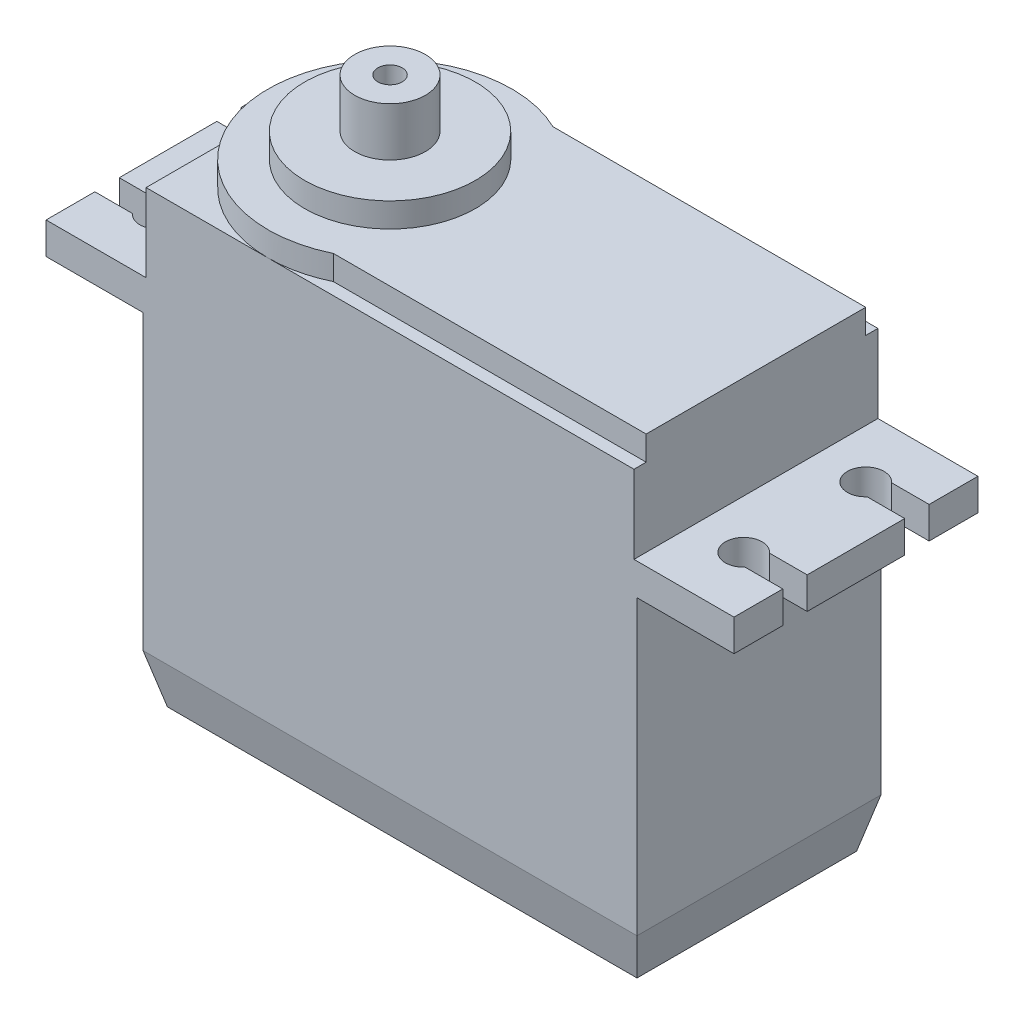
ISO-10303-21;
HEADER;
FILE_DESCRIPTION(('STEP AP214'),'2;1');
FILE_NAME('part.step','',(''),(''),'','','');
FILE_SCHEMA(('AUTOMOTIVE_DESIGN { 1 0 10303 214 1 1 1 1 }'));
ENDSEC;
DATA;
#1=APPLICATION_CONTEXT('core data for automotive mechanical design processes');
#2=APPLICATION_PROTOCOL_DEFINITION('international standard','automotive_design',2000,#1);
#3=PRODUCT_CONTEXT('',#1,'mechanical');
#4=PRODUCT('Part','Part','',(#3));
#5=PRODUCT_RELATED_PRODUCT_CATEGORY('part','',(#4));
#6=PRODUCT_DEFINITION_FORMATION('','',#4);
#7=PRODUCT_DEFINITION_CONTEXT('part definition',#1,'design');
#8=PRODUCT_DEFINITION('design','',#6,#7);
#9=PRODUCT_DEFINITION_SHAPE('','',#8);
#10=(LENGTH_UNIT() NAMED_UNIT(*) SI_UNIT(.MILLI.,.METRE.));
#11=(NAMED_UNIT(*) PLANE_ANGLE_UNIT() SI_UNIT($,.RADIAN.));
#12=(NAMED_UNIT(*) SI_UNIT($,.STERADIAN.) SOLID_ANGLE_UNIT());
#13=UNCERTAINTY_MEASURE_WITH_UNIT(LENGTH_MEASURE(1.E-05),#10,'distance_accuracy_value','');
#14=(GEOMETRIC_REPRESENTATION_CONTEXT(3) GLOBAL_UNCERTAINTY_ASSIGNED_CONTEXT((#13)) GLOBAL_UNIT_ASSIGNED_CONTEXT((#10,
#11,#12)) REPRESENTATION_CONTEXT('',''));
#15=CARTESIAN_POINT('',(0.,0.,0.));
#16=DIRECTION('',(0.,0.,1.));
#17=DIRECTION('',(1.,0.,0.));
#18=AXIS2_PLACEMENT_3D('',#15,#16,#17);
#19=CARTESIAN_POINT('',(-9.99999999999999,27.,10.));
#20=DIRECTION('',(0.,1.,0.));
#21=DIRECTION('',(0.,0.,1.));
#22=AXIS2_PLACEMENT_3D('',#19,#20,#21);
#23=PLANE('',#22);
#24=CARTESIAN_POINT('',(-9.99999999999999,27.,10.));
#25=DIRECTION('',(0.,1.,0.));
#26=DIRECTION('',(0.,0.,1.));
#27=AXIS2_PLACEMENT_3D('',#24,#25,#26);
#28=CIRCLE('',#27,7.);
#29=CARTESIAN_POINT('',(-9.99999999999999,27.,17.));
#30=VERTEX_POINT('',#29);
#31=EDGE_CURVE('E585',#30,#30,#28,.T.);
#32=ORIENTED_EDGE('',*,*,#31,.T.);
#33=EDGE_LOOP('',(#32));
#34=FACE_BOUND('',#33,.T.);
#35=CARTESIAN_POINT('',(-9.99999999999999,27.,10.));
#36=DIRECTION('',(0.,1.,0.));
#37=DIRECTION('',(0.,0.,1.));
#38=AXIS2_PLACEMENT_3D('',#35,#36,#37);
#39=CIRCLE('',#38,2.9);
#40=CARTESIAN_POINT('',(-9.99999999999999,27.,12.9));
#41=VERTEX_POINT('',#40);
#42=EDGE_CURVE('E628',#41,#41,#39,.T.);
#43=ORIENTED_EDGE('',*,*,#42,.F.);
#44=EDGE_LOOP('',(#43));
#45=FACE_BOUND('',#44,.T.);
#46=ADVANCED_FACE('F34',(#34,#45),#23,.T.);
#47=CARTESIAN_POINT('',(-9.99999999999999,25.,10.));
#48=DIRECTION('',(0.,1.,0.));
#49=DIRECTION('',(0.,0.,1.));
#50=AXIS2_PLACEMENT_3D('',#47,#48,#49);
#51=PLANE('',#50);
#52=DIRECTION('',(0.,0.,-1.));
#53=VECTOR('',#52,1.);
#54=CARTESIAN_POINT('',(20.,25.,19.));
#55=LINE('',#54,#53);
#56=CARTESIAN_POINT('',(20.,25.,19.));
#57=VERTEX_POINT('',#56);
#58=CARTESIAN_POINT('',(20.,25.,1.));
#59=VERTEX_POINT('',#58);
#60=EDGE_CURVE('E275',#57,#59,#55,.T.);
#61=ORIENTED_EDGE('',*,*,#60,.T.);
#62=DIRECTION('',(-1.,0.,0.));
#63=VECTOR('',#62,1.);
#64=CARTESIAN_POINT('',(20.,25.,1.));
#65=LINE('',#64,#63);
#66=CARTESIAN_POINT('',(-5.64110105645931,25.,1.));
#67=VERTEX_POINT('',#66);
#68=EDGE_CURVE('E264',#59,#67,#65,.T.);
#69=ORIENTED_EDGE('',*,*,#68,.T.);
#70=CARTESIAN_POINT('',(-9.99999999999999,25.,10.));
#71=DIRECTION('',(0.,1.,0.));
#72=DIRECTION('',(0.,0.,1.));
#73=AXIS2_PLACEMENT_3D('',#70,#71,#72);
#74=CIRCLE('',#73,10.);
#75=CARTESIAN_POINT('',(-5.64110105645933,25.,19.));
#76=VERTEX_POINT('',#75);
#77=EDGE_CURVE('E274',#67,#76,#74,.T.);
#78=ORIENTED_EDGE('',*,*,#77,.T.);
#79=DIRECTION('',(1.,0.,0.));
#80=VECTOR('',#79,1.);
#81=CARTESIAN_POINT('',(20.,25.,19.));
#82=LINE('',#81,#80);
#83=EDGE_CURVE('E281',#76,#57,#82,.T.);
#84=ORIENTED_EDGE('',*,*,#83,.T.);
#85=EDGE_LOOP('',(#61,#69,#78,#84));
#86=FACE_BOUND('',#85,.T.);
#87=CARTESIAN_POINT('',(-9.99999999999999,25.,10.));
#88=DIRECTION('',(0.,1.,0.));
#89=DIRECTION('',(0.,0.,1.));
#90=AXIS2_PLACEMENT_3D('',#87,#88,#89);
#91=CIRCLE('',#90,7.);
#92=CARTESIAN_POINT('',(-9.99999999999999,25.,17.));
#93=VERTEX_POINT('',#92);
#94=EDGE_CURVE('E623',#93,#93,#91,.T.);
#95=ORIENTED_EDGE('',*,*,#94,.F.);
#96=EDGE_LOOP('',(#95));
#97=FACE_BOUND('',#96,.T.);
#98=ADVANCED_FACE('F278',(#86,#97),#51,.T.);
#99=CARTESIAN_POINT('',(0.,23.,0.));
#100=DIRECTION('',(0.,1.,0.));
#101=DIRECTION('',(0.,0.,1.));
#102=AXIS2_PLACEMENT_3D('',#99,#100,#101);
#103=PLANE('',#102);
#104=DIRECTION('',(1.,0.,0.));
#105=VECTOR('',#104,1.);
#106=CARTESIAN_POINT('',(20.,23.,19.));
#107=LINE('',#106,#105);
#108=CARTESIAN_POINT('',(-5.64110105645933,23.,19.));
#109=VERTEX_POINT('',#108);
#110=CARTESIAN_POINT('',(20.,23.,19.));
#111=VERTEX_POINT('',#110);
#112=EDGE_CURVE('E285',#109,#111,#107,.T.);
#113=ORIENTED_EDGE('',*,*,#112,.F.);
#114=CARTESIAN_POINT('',(-9.99999999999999,23.,10.));
#115=DIRECTION('',(0.,1.,0.));
#116=DIRECTION('',(0.,0.,1.));
#117=AXIS2_PLACEMENT_3D('',#114,#115,#116);
#118=CIRCLE('',#117,10.);
#119=CARTESIAN_POINT('',(-9.99999999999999,23.,20.));
#120=VERTEX_POINT('',#119);
#121=EDGE_CURVE('E578',#120,#109,#118,.T.);
#122=ORIENTED_EDGE('',*,*,#121,.F.);
#123=DIRECTION('',(1.,0.,0.));
#124=VECTOR('',#123,1.);
#125=CARTESIAN_POINT('',(-20.,23.,20.));
#126=LINE('',#125,#124);
#127=CARTESIAN_POINT('',(20.,23.,20.));
#128=VERTEX_POINT('',#127);
#129=EDGE_CURVE('E462',#120,#128,#126,.T.);
#130=ORIENTED_EDGE('',*,*,#129,.T.);
#131=DIRECTION('',(0.,0.,-1.));
#132=VECTOR('',#131,1.);
#133=CARTESIAN_POINT('',(20.,23.,0.));
#134=LINE('',#133,#132);
#135=EDGE_CURVE('E473',#128,#111,#134,.T.);
#136=ORIENTED_EDGE('',*,*,#135,.T.);
#137=EDGE_LOOP('',(#113,#122,#130,#136));
#138=FACE_BOUND('',#137,.T.);
#139=ADVANCED_FACE('F576',(#138),#103,.T.);
#140=CARTESIAN_POINT('',(-20.,23.,10.));
#141=VERTEX_POINT('',#140);
#142=EDGE_CURVE('E573',#141,#120,#118,.T.);
#143=ORIENTED_EDGE('',*,*,#142,.F.);
#144=DIRECTION('',(0.,0.,1.));
#145=VECTOR('',#144,1.);
#146=CARTESIAN_POINT('',(-20.,23.,0.));
#147=LINE('',#146,#145);
#148=CARTESIAN_POINT('',(-20.,23.,20.));
#149=VERTEX_POINT('',#148);
#150=EDGE_CURVE('E458',#141,#149,#147,.T.);
#151=ORIENTED_EDGE('',*,*,#150,.T.);
#152=EDGE_CURVE('E463',#149,#120,#126,.T.);
#153=ORIENTED_EDGE('',*,*,#152,.T.);
#154=EDGE_LOOP('',(#143,#151,#153));
#155=FACE_BOUND('',#154,.T.);
#156=ADVANCED_FACE('F571',(#155),#103,.T.);
#157=CARTESIAN_POINT('',(-9.99999999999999,23.,0.));
#158=VERTEX_POINT('',#157);
#159=EDGE_CURVE('E478',#158,#141,#118,.T.);
#160=ORIENTED_EDGE('',*,*,#159,.F.);
#161=DIRECTION('',(-1.,0.,0.));
#162=VECTOR('',#161,1.);
#163=CARTESIAN_POINT('',(-20.,23.,0.));
#164=LINE('',#163,#162);
#165=CARTESIAN_POINT('',(-20.,23.,0.));
#166=VERTEX_POINT('',#165);
#167=EDGE_CURVE('E475',#158,#166,#164,.T.);
#168=ORIENTED_EDGE('',*,*,#167,.T.);
#169=EDGE_CURVE('E459',#166,#141,#147,.T.);
#170=ORIENTED_EDGE('',*,*,#169,.T.);
#171=EDGE_LOOP('',(#160,#168,#170));
#172=FACE_BOUND('',#171,.T.);
#173=ADVANCED_FACE('F561',(#172),#103,.T.);
#174=CARTESIAN_POINT('',(-28.2,14.,20.));
#175=DIRECTION('',(0.,-1.,0.));
#176=DIRECTION('',(0.,0.,-1.));
#177=AXIS2_PLACEMENT_3D('',#174,#175,#176);
#178=PLANE('',#177);
#179=CARTESIAN_POINT('',(-24.,14.,5.));
#180=DIRECTION('',(0.,-1.,0.));
#181=DIRECTION('',(0.,0.,-1.));
#182=AXIS2_PLACEMENT_3D('',#179,#180,#181);
#183=CIRCLE('',#182,1.5);
#184=CARTESIAN_POINT('',(-25.1180339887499,14.,6.));
#185=VERTEX_POINT('',#184);
#186=CARTESIAN_POINT('',(-25.1180339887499,14.,4.));
#187=VERTEX_POINT('',#186);
#188=EDGE_CURVE('E331',#185,#187,#183,.F.);
#189=ORIENTED_EDGE('',*,*,#188,.T.);
#190=DIRECTION('',(-1.,0.,0.));
#191=VECTOR('',#190,1.);
#192=CARTESIAN_POINT('',(-28.2,14.,4.));
#193=LINE('',#192,#191);
#194=CARTESIAN_POINT('',(-28.2,14.,4.));
#195=VERTEX_POINT('',#194);
#196=EDGE_CURVE('E328',#187,#195,#193,.T.);
#197=ORIENTED_EDGE('',*,*,#196,.T.);
#198=DIRECTION('',(0.,0.,-1.));
#199=VECTOR('',#198,1.);
#200=CARTESIAN_POINT('',(-28.2,14.,20.));
#201=LINE('',#200,#199);
#202=CARTESIAN_POINT('',(-28.2,14.,0.));
#203=VERTEX_POINT('',#202);
#204=EDGE_CURVE('E368',#195,#203,#201,.T.);
#205=ORIENTED_EDGE('',*,*,#204,.T.);
#206=DIRECTION('',(1.,0.,0.));
#207=VECTOR('',#206,1.);
#208=CARTESIAN_POINT('',(-28.2,14.,0.));
#209=LINE('',#208,#207);
#210=CARTESIAN_POINT('',(-20.25,14.,0.));
#211=VERTEX_POINT('',#210);
#212=EDGE_CURVE('E377',#203,#211,#209,.T.);
#213=ORIENTED_EDGE('',*,*,#212,.T.);
#214=DIRECTION('',(0.,0.,-1.));
#215=VECTOR('',#214,1.);
#216=CARTESIAN_POINT('',(-20.25,14.,20.));
#217=LINE('',#216,#215);
#218=CARTESIAN_POINT('',(-20.25,14.,20.));
#219=VERTEX_POINT('',#218);
#220=EDGE_CURVE('E519',#219,#211,#217,.T.);
#221=ORIENTED_EDGE('',*,*,#220,.F.);
#222=DIRECTION('',(1.,0.,0.));
#223=VECTOR('',#222,1.);
#224=CARTESIAN_POINT('',(-28.2,14.,20.));
#225=LINE('',#224,#223);
#226=CARTESIAN_POINT('',(-28.2,14.,20.));
#227=VERTEX_POINT('',#226);
#228=EDGE_CURVE('E372',#227,#219,#225,.T.);
#229=ORIENTED_EDGE('',*,*,#228,.F.);
#230=CARTESIAN_POINT('',(-28.2,14.,16.));
#231=VERTEX_POINT('',#230);
#232=EDGE_CURVE('E369',#227,#231,#201,.T.);
#233=ORIENTED_EDGE('',*,*,#232,.T.);
#234=DIRECTION('',(1.,0.,0.));
#235=VECTOR('',#234,1.);
#236=CARTESIAN_POINT('',(-28.2,14.,16.));
#237=LINE('',#236,#235);
#238=CARTESIAN_POINT('',(-25.1180339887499,14.,16.));
#239=VERTEX_POINT('',#238);
#240=EDGE_CURVE('E346',#231,#239,#237,.T.);
#241=ORIENTED_EDGE('',*,*,#240,.T.);
#242=CARTESIAN_POINT('',(-24.,14.,15.));
#243=DIRECTION('',(0.,-1.,0.));
#244=DIRECTION('',(0.,0.,-1.));
#245=AXIS2_PLACEMENT_3D('',#242,#243,#244);
#246=CIRCLE('',#245,1.5);
#247=CARTESIAN_POINT('',(-25.1180339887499,14.,14.));
#248=VERTEX_POINT('',#247);
#249=EDGE_CURVE('E353',#239,#248,#246,.F.);
#250=ORIENTED_EDGE('',*,*,#249,.T.);
#251=DIRECTION('',(-1.,0.,0.));
#252=VECTOR('',#251,1.);
#253=CARTESIAN_POINT('',(-28.2,14.,14.));
#254=LINE('',#253,#252);
#255=CARTESIAN_POINT('',(-28.2,14.,14.));
#256=VERTEX_POINT('',#255);
#257=EDGE_CURVE('E350',#248,#256,#254,.T.);
#258=ORIENTED_EDGE('',*,*,#257,.T.);
#259=CARTESIAN_POINT('',(-28.2,14.,6.));
#260=VERTEX_POINT('',#259);
#261=EDGE_CURVE('E373',#256,#260,#201,.T.);
#262=ORIENTED_EDGE('',*,*,#261,.T.);
#263=DIRECTION('',(1.,0.,0.));
#264=VECTOR('',#263,1.);
#265=CARTESIAN_POINT('',(-28.2,14.,6.));
#266=LINE('',#265,#264);
#267=EDGE_CURVE('E324',#260,#185,#266,.T.);
#268=ORIENTED_EDGE('',*,*,#267,.T.);
#269=EDGE_LOOP('',(#189,#197,#205,#213,#221,#229,#233,#241,#250,#258,#262,#268));
#270=FACE_BOUND('',#269,.T.);
#271=ADVANCED_FACE('F701',(#270),#178,.T.);
#272=CARTESIAN_POINT('',(-28.2,16.6,20.));
#273=DIRECTION('',(0.,1.,0.));
#274=DIRECTION('',(0.,0.,1.));
#275=AXIS2_PLACEMENT_3D('',#272,#273,#274);
#276=PLANE('',#275);
#277=DIRECTION('',(0.,0.,1.));
#278=VECTOR('',#277,1.);
#279=CARTESIAN_POINT('',(-28.2,16.6,20.));
#280=LINE('',#279,#278);
#281=CARTESIAN_POINT('',(-28.2,16.6,0.));
#282=VERTEX_POINT('',#281);
#283=CARTESIAN_POINT('',(-28.2,16.6,4.));
#284=VERTEX_POINT('',#283);
#285=EDGE_CURVE('E361',#282,#284,#280,.T.);
#286=ORIENTED_EDGE('',*,*,#285,.T.);
#287=DIRECTION('',(1.,0.,0.));
#288=VECTOR('',#287,1.);
#289=CARTESIAN_POINT('',(-28.2,16.6,4.));
#290=LINE('',#289,#288);
#291=CARTESIAN_POINT('',(-25.1180339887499,16.6,4.));
#292=VERTEX_POINT('',#291);
#293=EDGE_CURVE('E291',#284,#292,#290,.T.);
#294=ORIENTED_EDGE('',*,*,#293,.T.);
#295=CARTESIAN_POINT('',(-24.,16.6,5.));
#296=DIRECTION('',(0.,-1.,0.));
#297=DIRECTION('',(0.,0.,1.));
#298=AXIS2_PLACEMENT_3D('',#295,#296,#297);
#299=CIRCLE('',#298,1.5);
#300=CARTESIAN_POINT('',(-25.1180339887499,16.6,6.));
#301=VERTEX_POINT('',#300);
#302=EDGE_CURVE('E318',#292,#301,#299,.T.);
#303=ORIENTED_EDGE('',*,*,#302,.T.);
#304=DIRECTION('',(-1.,0.,0.));
#305=VECTOR('',#304,1.);
#306=CARTESIAN_POINT('',(-28.2,16.6,6.));
#307=LINE('',#306,#305);
#308=CARTESIAN_POINT('',(-28.2,16.6,6.));
#309=VERTEX_POINT('',#308);
#310=EDGE_CURVE('E294',#301,#309,#307,.T.);
#311=ORIENTED_EDGE('',*,*,#310,.T.);
#312=CARTESIAN_POINT('',(-28.2,16.6,14.));
#313=VERTEX_POINT('',#312);
#314=EDGE_CURVE('E365',#309,#313,#280,.T.);
#315=ORIENTED_EDGE('',*,*,#314,.T.);
#316=DIRECTION('',(1.,0.,0.));
#317=VECTOR('',#316,1.);
#318=CARTESIAN_POINT('',(-28.2,16.6,14.));
#319=LINE('',#318,#317);
#320=CARTESIAN_POINT('',(-25.1180339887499,16.6,14.));
#321=VERTEX_POINT('',#320);
#322=EDGE_CURVE('E340',#313,#321,#319,.T.);
#323=ORIENTED_EDGE('',*,*,#322,.T.);
#324=CARTESIAN_POINT('',(-24.,16.6,15.));
#325=DIRECTION('',(0.,-1.,0.));
#326=DIRECTION('',(0.,0.,1.));
#327=AXIS2_PLACEMENT_3D('',#324,#325,#326);
#328=CIRCLE('',#327,1.5);
#329=CARTESIAN_POINT('',(-25.1180339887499,16.6,16.));
#330=VERTEX_POINT('',#329);
#331=EDGE_CURVE('E337',#321,#330,#328,.T.);
#332=ORIENTED_EDGE('',*,*,#331,.T.);
#333=DIRECTION('',(-1.,0.,0.));
#334=VECTOR('',#333,1.);
#335=CARTESIAN_POINT('',(-28.2,16.6,16.));
#336=LINE('',#335,#334);
#337=CARTESIAN_POINT('',(-28.2,16.6,16.));
#338=VERTEX_POINT('',#337);
#339=EDGE_CURVE('E334',#330,#338,#336,.T.);
#340=ORIENTED_EDGE('',*,*,#339,.T.);
#341=CARTESIAN_POINT('',(-28.2,16.6,20.));
#342=VERTEX_POINT('',#341);
#343=EDGE_CURVE('E360',#338,#342,#280,.T.);
#344=ORIENTED_EDGE('',*,*,#343,.T.);
#345=DIRECTION('',(1.,0.,0.));
#346=VECTOR('',#345,1.);
#347=CARTESIAN_POINT('',(-28.2,16.6,20.));
#348=LINE('',#347,#346);
#349=CARTESIAN_POINT('',(-20.,16.6,20.));
#350=VERTEX_POINT('',#349);
#351=EDGE_CURVE('E383',#342,#350,#348,.T.);
#352=ORIENTED_EDGE('',*,*,#351,.T.);
#353=DIRECTION('',(0.,0.,1.));
#354=VECTOR('',#353,1.);
#355=CARTESIAN_POINT('',(-20.,16.6,20.));
#356=LINE('',#355,#354);
#357=CARTESIAN_POINT('',(-20.,16.6,0.));
#358=VERTEX_POINT('',#357);
#359=EDGE_CURVE('E356',#358,#350,#356,.T.);
#360=ORIENTED_EDGE('',*,*,#359,.F.);
#361=DIRECTION('',(1.,0.,0.));
#362=VECTOR('',#361,1.);
#363=CARTESIAN_POINT('',(-28.2,16.6,0.));
#364=LINE('',#363,#362);
#365=EDGE_CURVE('E380',#282,#358,#364,.T.);
#366=ORIENTED_EDGE('',*,*,#365,.F.);
#367=EDGE_LOOP('',(#286,#294,#303,#311,#315,#323,#332,#340,#344,#352,#360,#366));
#368=FACE_BOUND('',#367,.T.);
#369=ADVANCED_FACE('F733',(#368),#276,.T.);
#370=CARTESIAN_POINT('',(-28.2,0.,0.));
#371=DIRECTION('',(1.,0.,0.));
#372=DIRECTION('',(0.,0.,1.));
#373=AXIS2_PLACEMENT_3D('',#370,#371,#372);
#374=PLANE('',#373);
#375=DIRECTION('',(0.,-1.,0.));
#376=VECTOR('',#375,1.);
#377=CARTESIAN_POINT('',(-28.2,0.,4.));
#378=LINE('',#377,#376);
#379=EDGE_CURVE('E476',#284,#195,#378,.T.);
#380=ORIENTED_EDGE('',*,*,#379,.F.);
#381=ORIENTED_EDGE('',*,*,#285,.F.);
#382=DIRECTION('',(0.,1.,0.));
#383=VECTOR('',#382,1.);
#384=CARTESIAN_POINT('',(-28.2,14.,0.));
#385=LINE('',#384,#383);
#386=EDGE_CURVE('E364',#203,#282,#385,.T.);
#387=ORIENTED_EDGE('',*,*,#386,.F.);
#388=ORIENTED_EDGE('',*,*,#204,.F.);
#389=EDGE_LOOP('',(#380,#381,#387,#388));
#390=FACE_BOUND('',#389,.T.);
#391=ADVANCED_FACE('F731',(#390),#374,.F.);
#392=DIRECTION('',(0.,1.,0.));
#393=VECTOR('',#392,1.);
#394=CARTESIAN_POINT('',(-28.2,0.,6.));
#395=LINE('',#394,#393);
#396=EDGE_CURVE('E479',#260,#309,#395,.T.);
#397=ORIENTED_EDGE('',*,*,#396,.F.);
#398=ORIENTED_EDGE('',*,*,#261,.F.);
#399=DIRECTION('',(0.,-1.,0.));
#400=VECTOR('',#399,1.);
#401=CARTESIAN_POINT('',(-28.2,0.,14.));
#402=LINE('',#401,#400);
#403=EDGE_CURVE('E481',#313,#256,#402,.T.);
#404=ORIENTED_EDGE('',*,*,#403,.F.);
#405=ORIENTED_EDGE('',*,*,#314,.F.);
#406=EDGE_LOOP('',(#397,#398,#404,#405));
#407=FACE_BOUND('',#406,.T.);
#408=ADVANCED_FACE('F724',(#407),#374,.F.);
#409=DIRECTION('',(0.,1.,0.));
#410=VECTOR('',#409,1.);
#411=CARTESIAN_POINT('',(-28.2,0.,16.));
#412=LINE('',#411,#410);
#413=EDGE_CURVE('E483',#231,#338,#412,.T.);
#414=ORIENTED_EDGE('',*,*,#413,.F.);
#415=ORIENTED_EDGE('',*,*,#232,.F.);
#416=DIRECTION('',(0.,-1.,0.));
#417=VECTOR('',#416,1.);
#418=CARTESIAN_POINT('',(-28.2,14.,20.));
#419=LINE('',#418,#417);
#420=EDGE_CURVE('E357',#342,#227,#419,.T.);
#421=ORIENTED_EDGE('',*,*,#420,.F.);
#422=ORIENTED_EDGE('',*,*,#343,.F.);
#423=EDGE_LOOP('',(#414,#415,#421,#422));
#424=FACE_BOUND('',#423,.T.);
#425=ADVANCED_FACE('F707',(#424),#374,.F.);
#426=CARTESIAN_POINT('',(28.2,0.,0.));
#427=DIRECTION('',(-1.,0.,0.));
#428=DIRECTION('',(0.,0.,1.));
#429=AXIS2_PLACEMENT_3D('',#426,#427,#428);
#430=PLANE('',#429);
#431=DIRECTION('',(0.,0.,1.));
#432=VECTOR('',#431,1.);
#433=CARTESIAN_POINT('',(28.2,16.6,20.));
#434=LINE('',#433,#432);
#435=CARTESIAN_POINT('',(28.2,16.6,0.));
#436=VERTEX_POINT('',#435);
#437=CARTESIAN_POINT('',(28.2,16.6,4.));
#438=VERTEX_POINT('',#437);
#439=EDGE_CURVE('E440',#436,#438,#434,.T.);
#440=ORIENTED_EDGE('',*,*,#439,.T.);
#441=DIRECTION('',(0.,-1.,0.));
#442=VECTOR('',#441,1.);
#443=CARTESIAN_POINT('',(28.2,0.,4.));
#444=LINE('',#443,#442);
#445=CARTESIAN_POINT('',(28.2,14.,4.));
#446=VERTEX_POINT('',#445);
#447=EDGE_CURVE('E485',#438,#446,#444,.T.);
#448=ORIENTED_EDGE('',*,*,#447,.T.);
#449=DIRECTION('',(0.,0.,-1.));
#450=VECTOR('',#449,1.);
#451=CARTESIAN_POINT('',(28.2,14.,20.));
#452=LINE('',#451,#450);
#453=CARTESIAN_POINT('',(28.2,14.,0.));
#454=VERTEX_POINT('',#453);
#455=EDGE_CURVE('E432',#446,#454,#452,.T.);
#456=ORIENTED_EDGE('',*,*,#455,.T.);
#457=DIRECTION('',(0.,1.,0.));
#458=VECTOR('',#457,1.);
#459=CARTESIAN_POINT('',(28.2,14.,0.));
#460=LINE('',#459,#458);
#461=EDGE_CURVE('E436',#454,#436,#460,.T.);
#462=ORIENTED_EDGE('',*,*,#461,.T.);
#463=EDGE_LOOP('',(#440,#448,#456,#462));
#464=FACE_BOUND('',#463,.T.);
#465=ADVANCED_FACE('F791',(#464),#430,.F.);
#466=CARTESIAN_POINT('',(28.2,14.,20.));
#467=VERTEX_POINT('',#466);
#468=CARTESIAN_POINT('',(28.2,14.,16.));
#469=VERTEX_POINT('',#468);
#470=EDGE_CURVE('E433',#467,#469,#452,.T.);
#471=ORIENTED_EDGE('',*,*,#470,.T.);
#472=DIRECTION('',(0.,1.,0.));
#473=VECTOR('',#472,1.);
#474=CARTESIAN_POINT('',(28.2,0.,16.));
#475=LINE('',#474,#473);
#476=CARTESIAN_POINT('',(28.2,16.6,16.));
#477=VERTEX_POINT('',#476);
#478=EDGE_CURVE('E491',#469,#477,#475,.T.);
#479=ORIENTED_EDGE('',*,*,#478,.T.);
#480=CARTESIAN_POINT('',(28.2,16.6,20.));
#481=VERTEX_POINT('',#480);
#482=EDGE_CURVE('E439',#477,#481,#434,.T.);
#483=ORIENTED_EDGE('',*,*,#482,.T.);
#484=DIRECTION('',(0.,-1.,0.));
#485=VECTOR('',#484,1.);
#486=CARTESIAN_POINT('',(28.2,14.,20.));
#487=LINE('',#486,#485);
#488=EDGE_CURVE('E429',#481,#467,#487,.T.);
#489=ORIENTED_EDGE('',*,*,#488,.T.);
#490=EDGE_LOOP('',(#471,#479,#483,#489));
#491=FACE_BOUND('',#490,.T.);
#492=ADVANCED_FACE('F539',(#491),#430,.F.);
#493=CARTESIAN_POINT('',(20.,23.,0.));
#494=DIRECTION('',(-1.,0.,0.));
#495=DIRECTION('',(0.,0.,1.));
#496=AXIS2_PLACEMENT_3D('',#493,#494,#495);
#497=PLANE('',#496);
#498=DIRECTION('',(0.,0.,1.));
#499=VECTOR('',#498,1.);
#500=CARTESIAN_POINT('',(20.,16.6,20.));
#501=LINE('',#500,#499);
#502=CARTESIAN_POINT('',(20.,16.6,0.));
#503=VERTEX_POINT('',#502);
#504=CARTESIAN_POINT('',(20.,16.6,20.));
#505=VERTEX_POINT('',#504);
#506=EDGE_CURVE('E428',#503,#505,#501,.T.);
#507=ORIENTED_EDGE('',*,*,#506,.F.);
#508=DIRECTION('',(0.,-1.,0.));
#509=VECTOR('',#508,1.);
#510=CARTESIAN_POINT('',(20.,23.,0.));
#511=LINE('',#510,#509);
#512=CARTESIAN_POINT('',(20.,23.,0.));
#513=VERTEX_POINT('',#512);
#514=EDGE_CURVE('E502',#513,#503,#511,.T.);
#515=ORIENTED_EDGE('',*,*,#514,.F.);
#516=CARTESIAN_POINT('',(20.,23.,1.));
#517=VERTEX_POINT('',#516);
#518=EDGE_CURVE('E290',#517,#513,#134,.T.);
#519=ORIENTED_EDGE('',*,*,#518,.F.);
#520=DIRECTION('',(0.,-1.,0.));
#521=VECTOR('',#520,1.);
#522=CARTESIAN_POINT('',(20.,25.,1.));
#523=LINE('',#522,#521);
#524=EDGE_CURVE('E269',#59,#517,#523,.T.);
#525=ORIENTED_EDGE('',*,*,#524,.F.);
#526=ORIENTED_EDGE('',*,*,#60,.F.);
#527=DIRECTION('',(0.,-1.,0.));
#528=VECTOR('',#527,1.);
#529=CARTESIAN_POINT('',(20.,25.,19.));
#530=LINE('',#529,#528);
#531=EDGE_CURVE('E308',#57,#111,#530,.T.);
#532=ORIENTED_EDGE('',*,*,#531,.T.);
#533=ORIENTED_EDGE('',*,*,#135,.F.);
#534=DIRECTION('',(0.,-1.,0.));
#535=VECTOR('',#534,1.);
#536=CARTESIAN_POINT('',(20.,23.,20.));
#537=LINE('',#536,#535);
#538=EDGE_CURVE('E509',#128,#505,#537,.T.);
#539=ORIENTED_EDGE('',*,*,#538,.T.);
#540=EDGE_LOOP('',(#507,#515,#519,#525,#526,#532,#533,#539));
#541=FACE_BOUND('',#540,.T.);
#542=ADVANCED_FACE('F288',(#541),#497,.F.);
#543=CARTESIAN_POINT('',(20.25,14.,20.));
#544=DIRECTION('',(-1.,0.,0.));
#545=DIRECTION('',(0.,-1.,0.));
#546=AXIS2_PLACEMENT_3D('',#543,#544,#545);
#547=PLANE('',#546);
#548=DIRECTION('',(0.,1.,0.));
#549=VECTOR('',#548,1.);
#550=CARTESIAN_POINT('',(20.25,14.,20.));
#551=LINE('',#550,#549);
#552=CARTESIAN_POINT('',(20.25,-9.99999999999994,20.));
#553=VERTEX_POINT('',#552);
#554=CARTESIAN_POINT('',(20.25,14.,20.));
#555=VERTEX_POINT('',#554);
#556=EDGE_CURVE('E524',#553,#555,#551,.T.);
#557=ORIENTED_EDGE('',*,*,#556,.F.);
#558=DIRECTION('',(0.,0.,-1.));
#559=VECTOR('',#558,1.);
#560=CARTESIAN_POINT('',(20.25,-9.99999999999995,20.));
#561=LINE('',#560,#559);
#562=CARTESIAN_POINT('',(20.25,-9.99999999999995,0.));
#563=VERTEX_POINT('',#562);
#564=EDGE_CURVE('E678',#553,#563,#561,.T.);
#565=ORIENTED_EDGE('',*,*,#564,.T.);
#566=DIRECTION('',(0.,1.,0.));
#567=VECTOR('',#566,1.);
#568=CARTESIAN_POINT('',(20.25,14.,0.));
#569=LINE('',#568,#567);
#570=CARTESIAN_POINT('',(20.25,14.,0.));
#571=VERTEX_POINT('',#570);
#572=EDGE_CURVE('E508',#563,#571,#569,.T.);
#573=ORIENTED_EDGE('',*,*,#572,.T.);
#574=DIRECTION('',(0.,0.,-1.));
#575=VECTOR('',#574,1.);
#576=CARTESIAN_POINT('',(20.25,14.,20.));
#577=LINE('',#576,#575);
#578=EDGE_CURVE('E497',#555,#571,#577,.T.);
#579=ORIENTED_EDGE('',*,*,#578,.F.);
#580=EDGE_LOOP('',(#557,#565,#573,#579));
#581=FACE_BOUND('',#580,.T.);
#582=ADVANCED_FACE('F532',(#581),#547,.F.);
#583=CARTESIAN_POINT('',(-20.25,14.,20.));
#584=DIRECTION('',(1.,0.,0.));
#585=DIRECTION('',(0.,1.,0.));
#586=AXIS2_PLACEMENT_3D('',#583,#584,#585);
#587=PLANE('',#586);
#588=DIRECTION('',(0.,-1.,0.));
#589=VECTOR('',#588,1.);
#590=CARTESIAN_POINT('',(-20.25,14.,0.));
#591=LINE('',#590,#589);
#592=CARTESIAN_POINT('',(-20.25,-9.99999999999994,0.));
#593=VERTEX_POINT('',#592);
#594=EDGE_CURVE('E522',#211,#593,#591,.T.);
#595=ORIENTED_EDGE('',*,*,#594,.T.);
#596=DIRECTION('',(0.,0.,1.));
#597=VECTOR('',#596,1.);
#598=CARTESIAN_POINT('',(-20.25,-9.99999999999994,20.));
#599=LINE('',#598,#597);
#600=CARTESIAN_POINT('',(-20.25,-9.99999999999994,20.));
#601=VERTEX_POINT('',#600);
#602=EDGE_CURVE('E43',#593,#601,#599,.T.);
#603=ORIENTED_EDGE('',*,*,#602,.T.);
#604=DIRECTION('',(0.,-1.,0.));
#605=VECTOR('',#604,1.);
#606=CARTESIAN_POINT('',(-20.25,14.,20.));
#607=LINE('',#606,#605);
#608=EDGE_CURVE('E521',#219,#601,#607,.T.);
#609=ORIENTED_EDGE('',*,*,#608,.F.);
#610=ORIENTED_EDGE('',*,*,#220,.T.);
#611=EDGE_LOOP('',(#595,#603,#609,#610));
#612=FACE_BOUND('',#611,.T.);
#613=ADVANCED_FACE('F698',(#612),#587,.F.);
#614=CARTESIAN_POINT('',(-20.25,-14.,20.));
#615=DIRECTION('',(0.,1.,0.));
#616=DIRECTION('',(0.,0.,1.));
#617=AXIS2_PLACEMENT_3D('',#614,#615,#616);
#618=PLANE('',#617);
#619=DIRECTION('',(0.,0.,-1.));
#620=VECTOR('',#619,1.);
#621=CARTESIAN_POINT('',(-19.25,-14.,20.));
#622=LINE('',#621,#620);
#623=CARTESIAN_POINT('',(-19.25,-14.,19.));
#624=VERTEX_POINT('',#623);
#625=CARTESIAN_POINT('',(-19.25,-14.,1.));
#626=VERTEX_POINT('',#625);
#627=EDGE_CURVE('E582',#624,#626,#622,.T.);
#628=ORIENTED_EDGE('',*,*,#627,.T.);
#629=DIRECTION('',(1.,0.,0.));
#630=VECTOR('',#629,1.);
#631=CARTESIAN_POINT('',(-20.25,-14.,1.));
#632=LINE('',#631,#630);
#633=CARTESIAN_POINT('',(19.25,-14.,1.));
#634=VERTEX_POINT('',#633);
#635=EDGE_CURVE('E684',#626,#634,#632,.T.);
#636=ORIENTED_EDGE('',*,*,#635,.T.);
#637=DIRECTION('',(0.,0.,1.));
#638=VECTOR('',#637,1.);
#639=CARTESIAN_POINT('',(19.25,-14.,20.));
#640=LINE('',#639,#638);
#641=CARTESIAN_POINT('',(19.25,-14.,19.));
#642=VERTEX_POINT('',#641);
#643=EDGE_CURVE('E1128',#634,#642,#640,.T.);
#644=ORIENTED_EDGE('',*,*,#643,.T.);
#645=DIRECTION('',(-1.,0.,0.));
#646=VECTOR('',#645,1.);
#647=CARTESIAN_POINT('',(-20.25,-14.,19.));
#648=LINE('',#647,#646);
#649=EDGE_CURVE('E581',#642,#624,#648,.T.);
#650=ORIENTED_EDGE('',*,*,#649,.T.);
#651=EDGE_LOOP('',(#628,#636,#644,#650));
#652=FACE_BOUND('',#651,.T.);
#653=ADVANCED_FACE('F805',(#652),#618,.F.);
#654=CARTESIAN_POINT('',(0.,0.,20.));
#655=DIRECTION('',(0.,0.,1.));
#656=DIRECTION('',(1.,0.,0.));
#657=AXIS2_PLACEMENT_3D('',#654,#655,#656);
#658=PLANE('',#657);
#659=ORIENTED_EDGE('',*,*,#608,.T.);
#660=DIRECTION('',(1.,0.,0.));
#661=VECTOR('',#660,1.);
#662=CARTESIAN_POINT('',(20.25,-9.99999999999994,20.));
#663=LINE('',#662,#661);
#664=EDGE_CURVE('E11',#601,#553,#663,.T.);
#665=ORIENTED_EDGE('',*,*,#664,.T.);
#666=ORIENTED_EDGE('',*,*,#556,.T.);
#667=DIRECTION('',(-1.,0.,0.));
#668=VECTOR('',#667,1.);
#669=CARTESIAN_POINT('',(28.2,14.,20.));
#670=LINE('',#669,#668);
#671=EDGE_CURVE('E455',#467,#555,#670,.T.);
#672=ORIENTED_EDGE('',*,*,#671,.F.);
#673=ORIENTED_EDGE('',*,*,#488,.F.);
#674=DIRECTION('',(-1.,0.,0.));
#675=VECTOR('',#674,1.);
#676=CARTESIAN_POINT('',(28.2,16.6,20.));
#677=LINE('',#676,#675);
#678=EDGE_CURVE('E443',#481,#505,#677,.T.);
#679=ORIENTED_EDGE('',*,*,#678,.T.);
#680=ORIENTED_EDGE('',*,*,#538,.F.);
#681=ORIENTED_EDGE('',*,*,#129,.F.);
#682=ORIENTED_EDGE('',*,*,#152,.F.);
#683=DIRECTION('',(0.,-1.,0.));
#684=VECTOR('',#683,1.);
#685=CARTESIAN_POINT('',(-20.,23.,20.));
#686=LINE('',#685,#684);
#687=EDGE_CURVE('E505',#149,#350,#686,.T.);
#688=ORIENTED_EDGE('',*,*,#687,.T.);
#689=ORIENTED_EDGE('',*,*,#351,.F.);
#690=ORIENTED_EDGE('',*,*,#420,.T.);
#691=ORIENTED_EDGE('',*,*,#228,.T.);
#692=EDGE_LOOP('',(#659,#665,#666,#672,#673,#679,#680,#681,#682,#688,#689,#690,#691));
#693=FACE_BOUND('',#692,.T.);
#694=ADVANCED_FACE('F528',(#693),#658,.T.);
#695=CARTESIAN_POINT('',(0.,0.,0.));
#696=DIRECTION('',(0.,0.,1.));
#697=DIRECTION('',(1.,0.,0.));
#698=AXIS2_PLACEMENT_3D('',#695,#696,#697);
#699=PLANE('',#698);
#700=ORIENTED_EDGE('',*,*,#572,.F.);
#701=DIRECTION('',(-1.,0.,0.));
#702=VECTOR('',#701,1.);
#703=CARTESIAN_POINT('',(0.,-9.99999999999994,0.));
#704=LINE('',#703,#702);
#705=EDGE_CURVE('E680',#563,#593,#704,.T.);
#706=ORIENTED_EDGE('',*,*,#705,.T.);
#707=ORIENTED_EDGE('',*,*,#594,.F.);
#708=ORIENTED_EDGE('',*,*,#212,.F.);
#709=ORIENTED_EDGE('',*,*,#386,.T.);
#710=ORIENTED_EDGE('',*,*,#365,.T.);
#711=DIRECTION('',(0.,-1.,0.));
#712=VECTOR('',#711,1.);
#713=CARTESIAN_POINT('',(-20.,23.,0.));
#714=LINE('',#713,#712);
#715=EDGE_CURVE('E500',#166,#358,#714,.T.);
#716=ORIENTED_EDGE('',*,*,#715,.F.);
#717=ORIENTED_EDGE('',*,*,#167,.F.);
#718=EDGE_CURVE('E468',#513,#158,#164,.T.);
#719=ORIENTED_EDGE('',*,*,#718,.F.);
#720=ORIENTED_EDGE('',*,*,#514,.T.);
#721=DIRECTION('',(-1.,0.,0.));
#722=VECTOR('',#721,1.);
#723=CARTESIAN_POINT('',(28.2,16.6,0.));
#724=LINE('',#723,#722);
#725=EDGE_CURVE('E449',#436,#503,#724,.T.);
#726=ORIENTED_EDGE('',*,*,#725,.F.);
#727=ORIENTED_EDGE('',*,*,#461,.F.);
#728=DIRECTION('',(-1.,0.,0.));
#729=VECTOR('',#728,1.);
#730=CARTESIAN_POINT('',(28.2,14.,0.));
#731=LINE('',#730,#729);
#732=EDGE_CURVE('E452',#454,#571,#731,.T.);
#733=ORIENTED_EDGE('',*,*,#732,.T.);
#734=EDGE_LOOP('',(#700,#706,#707,#708,#709,#710,#716,#717,#719,#720,#726,#727,#733));
#735=FACE_BOUND('',#734,.T.);
#736=ADVANCED_FACE('F553',(#735),#699,.F.);
#737=CARTESIAN_POINT('',(-20.,23.,0.));
#738=DIRECTION('',(1.,0.,0.));
#739=DIRECTION('',(0.,0.,-1.));
#740=AXIS2_PLACEMENT_3D('',#737,#738,#739);
#741=PLANE('',#740);
#742=ORIENTED_EDGE('',*,*,#715,.T.);
#743=ORIENTED_EDGE('',*,*,#359,.T.);
#744=ORIENTED_EDGE('',*,*,#687,.F.);
#745=ORIENTED_EDGE('',*,*,#150,.F.);
#746=ORIENTED_EDGE('',*,*,#169,.F.);
#747=EDGE_LOOP('',(#742,#743,#744,#745,#746));
#748=FACE_BOUND('',#747,.T.);
#749=ADVANCED_FACE('F567',(#748),#741,.F.);
#750=CARTESIAN_POINT('',(-5.64110105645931,23.,1.));
#751=VERTEX_POINT('',#750);
#752=EDGE_CURVE('E307',#751,#158,#118,.T.);
#753=ORIENTED_EDGE('',*,*,#752,.F.);
#754=DIRECTION('',(-1.,0.,0.));
#755=VECTOR('',#754,1.);
#756=CARTESIAN_POINT('',(20.,23.,1.));
#757=LINE('',#756,#755);
#758=EDGE_CURVE('E584',#517,#751,#757,.T.);
#759=ORIENTED_EDGE('',*,*,#758,.F.);
#760=ORIENTED_EDGE('',*,*,#518,.T.);
#761=ORIENTED_EDGE('',*,*,#718,.T.);
#762=EDGE_LOOP('',(#753,#759,#760,#761));
#763=FACE_BOUND('',#762,.T.);
#764=ADVANCED_FACE('F796',(#763),#103,.T.);
#765=CARTESIAN_POINT('',(28.2,14.,20.));
#766=DIRECTION('',(0.,1.,0.));
#767=DIRECTION('',(0.,0.,1.));
#768=AXIS2_PLACEMENT_3D('',#765,#766,#767);
#769=PLANE('',#768);
#770=ORIENTED_EDGE('',*,*,#455,.F.);
#771=DIRECTION('',(-1.,0.,0.));
#772=VECTOR('',#771,1.);
#773=CARTESIAN_POINT('',(28.2,14.,4.));
#774=LINE('',#773,#772);
#775=CARTESIAN_POINT('',(25.1180339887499,14.,4.));
#776=VERTEX_POINT('',#775);
#777=EDGE_CURVE('E401',#446,#776,#774,.T.);
#778=ORIENTED_EDGE('',*,*,#777,.T.);
#779=CARTESIAN_POINT('',(24.,14.,5.));
#780=DIRECTION('',(0.,1.,0.));
#781=DIRECTION('',(0.,0.,1.));
#782=AXIS2_PLACEMENT_3D('',#779,#780,#781);
#783=CIRCLE('',#782,1.5);
#784=CARTESIAN_POINT('',(25.1180339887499,14.,6.));
#785=VERTEX_POINT('',#784);
#786=EDGE_CURVE('E404',#776,#785,#783,.T.);
#787=ORIENTED_EDGE('',*,*,#786,.T.);
#788=DIRECTION('',(1.,0.,0.));
#789=VECTOR('',#788,1.);
#790=CARTESIAN_POINT('',(28.2,14.,6.));
#791=LINE('',#790,#789);
#792=CARTESIAN_POINT('',(28.2,14.,6.));
#793=VERTEX_POINT('',#792);
#794=EDGE_CURVE('E397',#785,#793,#791,.T.);
#795=ORIENTED_EDGE('',*,*,#794,.T.);
#796=CARTESIAN_POINT('',(28.2,14.,14.));
#797=VERTEX_POINT('',#796);
#798=EDGE_CURVE('E437',#797,#793,#452,.T.);
#799=ORIENTED_EDGE('',*,*,#798,.F.);
#800=DIRECTION('',(-1.,0.,0.));
#801=VECTOR('',#800,1.);
#802=CARTESIAN_POINT('',(28.2,14.,14.));
#803=LINE('',#802,#801);
#804=CARTESIAN_POINT('',(25.1180339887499,14.,14.));
#805=VERTEX_POINT('',#804);
#806=EDGE_CURVE('E418',#797,#805,#803,.T.);
#807=ORIENTED_EDGE('',*,*,#806,.T.);
#808=CARTESIAN_POINT('',(24.,14.,15.));
#809=DIRECTION('',(0.,1.,0.));
#810=DIRECTION('',(0.,0.,1.));
#811=AXIS2_PLACEMENT_3D('',#808,#809,#810);
#812=CIRCLE('',#811,1.5);
#813=CARTESIAN_POINT('',(25.1180339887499,14.,16.));
#814=VERTEX_POINT('',#813);
#815=EDGE_CURVE('E425',#805,#814,#812,.T.);
#816=ORIENTED_EDGE('',*,*,#815,.T.);
#817=DIRECTION('',(1.,0.,0.));
#818=VECTOR('',#817,1.);
#819=CARTESIAN_POINT('',(28.2,14.,16.));
#820=LINE('',#819,#818);
#821=EDGE_CURVE('E422',#814,#469,#820,.T.);
#822=ORIENTED_EDGE('',*,*,#821,.T.);
#823=ORIENTED_EDGE('',*,*,#470,.F.);
#824=ORIENTED_EDGE('',*,*,#671,.T.);
#825=ORIENTED_EDGE('',*,*,#578,.T.);
#826=ORIENTED_EDGE('',*,*,#732,.F.);
#827=EDGE_LOOP('',(#770,#778,#787,#795,#799,#807,#816,#822,#823,#824,#825,#826));
#828=FACE_BOUND('',#827,.T.);
#829=ADVANCED_FACE('F537',(#828),#769,.F.);
#830=CARTESIAN_POINT('',(28.2,16.6,20.));
#831=DIRECTION('',(0.,-1.,0.));
#832=DIRECTION('',(0.,0.,-1.));
#833=AXIS2_PLACEMENT_3D('',#830,#831,#832);
#834=PLANE('',#833);
#835=CARTESIAN_POINT('',(24.,16.6,5.));
#836=DIRECTION('',(0.,1.,0.));
#837=DIRECTION('',(0.,0.,1.));
#838=AXIS2_PLACEMENT_3D('',#835,#836,#837);
#839=CIRCLE('',#838,1.5);
#840=CARTESIAN_POINT('',(25.1180339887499,16.6,4.));
#841=VERTEX_POINT('',#840);
#842=CARTESIAN_POINT('',(25.1180339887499,16.6,6.));
#843=VERTEX_POINT('',#842);
#844=EDGE_CURVE('E389',#841,#843,#839,.T.);
#845=ORIENTED_EDGE('',*,*,#844,.F.);
#846=DIRECTION('',(-1.,0.,0.));
#847=VECTOR('',#846,1.);
#848=CARTESIAN_POINT('',(28.2,16.6,4.));
#849=LINE('',#848,#847);
#850=EDGE_CURVE('E386',#438,#841,#849,.T.);
#851=ORIENTED_EDGE('',*,*,#850,.F.);
#852=ORIENTED_EDGE('',*,*,#439,.F.);
#853=ORIENTED_EDGE('',*,*,#725,.T.);
#854=ORIENTED_EDGE('',*,*,#506,.T.);
#855=ORIENTED_EDGE('',*,*,#678,.F.);
#856=ORIENTED_EDGE('',*,*,#482,.F.);
#857=DIRECTION('',(1.,0.,0.));
#858=VECTOR('',#857,1.);
#859=CARTESIAN_POINT('',(28.2,16.6,16.));
#860=LINE('',#859,#858);
#861=CARTESIAN_POINT('',(25.1180339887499,16.6,16.));
#862=VERTEX_POINT('',#861);
#863=EDGE_CURVE('E413',#862,#477,#860,.T.);
#864=ORIENTED_EDGE('',*,*,#863,.F.);
#865=CARTESIAN_POINT('',(24.,16.6,15.));
#866=DIRECTION('',(0.,1.,0.));
#867=DIRECTION('',(0.,0.,1.));
#868=AXIS2_PLACEMENT_3D('',#865,#866,#867);
#869=CIRCLE('',#868,1.5);
#870=CARTESIAN_POINT('',(25.1180339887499,16.6,14.));
#871=VERTEX_POINT('',#870);
#872=EDGE_CURVE('E410',#871,#862,#869,.T.);
#873=ORIENTED_EDGE('',*,*,#872,.F.);
#874=DIRECTION('',(-1.,0.,0.));
#875=VECTOR('',#874,1.);
#876=CARTESIAN_POINT('',(28.2,16.6,14.));
#877=LINE('',#876,#875);
#878=CARTESIAN_POINT('',(28.2,16.6,14.));
#879=VERTEX_POINT('',#878);
#880=EDGE_CURVE('E407',#879,#871,#877,.T.);
#881=ORIENTED_EDGE('',*,*,#880,.F.);
#882=CARTESIAN_POINT('',(28.2,16.6,6.));
#883=VERTEX_POINT('',#882);
#884=EDGE_CURVE('E444',#883,#879,#434,.T.);
#885=ORIENTED_EDGE('',*,*,#884,.F.);
#886=DIRECTION('',(1.,0.,0.));
#887=VECTOR('',#886,1.);
#888=CARTESIAN_POINT('',(28.2,16.6,6.));
#889=LINE('',#888,#887);
#890=EDGE_CURVE('E392',#843,#883,#889,.T.);
#891=ORIENTED_EDGE('',*,*,#890,.F.);
#892=EDGE_LOOP('',(#845,#851,#852,#853,#854,#855,#856,#864,#873,#881,#885,#891));
#893=FACE_BOUND('',#892,.T.);
#894=ADVANCED_FACE('F547',(#893),#834,.F.);
#895=ORIENTED_EDGE('',*,*,#798,.T.);
#896=DIRECTION('',(0.,1.,0.));
#897=VECTOR('',#896,1.);
#898=CARTESIAN_POINT('',(28.2,0.,6.));
#899=LINE('',#898,#897);
#900=EDGE_CURVE('E488',#793,#883,#899,.T.);
#901=ORIENTED_EDGE('',*,*,#900,.T.);
#902=ORIENTED_EDGE('',*,*,#884,.T.);
#903=DIRECTION('',(0.,-1.,0.));
#904=VECTOR('',#903,1.);
#905=CARTESIAN_POINT('',(28.2,0.,14.));
#906=LINE('',#905,#904);
#907=EDGE_CURVE('E494',#879,#797,#906,.T.);
#908=ORIENTED_EDGE('',*,*,#907,.T.);
#909=EDGE_LOOP('',(#895,#901,#902,#908));
#910=FACE_BOUND('',#909,.T.);
#911=ADVANCED_FACE('F783',(#910),#430,.F.);
#912=CARTESIAN_POINT('',(24.,8.4,15.));
#913=DIRECTION('',(0.,1.,0.));
#914=DIRECTION('',(0.,0.,1.));
#915=AXIS2_PLACEMENT_3D('',#912,#913,#914);
#916=CYLINDRICAL_SURFACE('',#915,1.5);
#917=DIRECTION('',(0.,1.,0.));
#918=VECTOR('',#917,1.);
#919=CARTESIAN_POINT('',(25.1180339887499,8.4,14.));
#920=LINE('',#919,#918);
#921=EDGE_CURVE('E415',#805,#871,#920,.T.);
#922=ORIENTED_EDGE('',*,*,#921,.T.);
#923=ORIENTED_EDGE('',*,*,#872,.T.);
#924=DIRECTION('',(0.,1.,0.));
#925=VECTOR('',#924,1.);
#926=CARTESIAN_POINT('',(25.1180339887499,8.4,16.));
#927=LINE('',#926,#925);
#928=EDGE_CURVE('E416',#814,#862,#927,.T.);
#929=ORIENTED_EDGE('',*,*,#928,.F.);
#930=ORIENTED_EDGE('',*,*,#815,.F.);
#931=EDGE_LOOP('',(#922,#923,#929,#930));
#932=FACE_BOUND('',#931,.T.);
#933=ADVANCED_FACE('F779',(#932),#916,.F.);
#934=CARTESIAN_POINT('',(28.2,8.4,16.));
#935=DIRECTION('',(0.,0.,1.));
#936=DIRECTION('',(1.,0.,0.));
#937=AXIS2_PLACEMENT_3D('',#934,#935,#936);
#938=PLANE('',#937);
#939=ORIENTED_EDGE('',*,*,#928,.T.);
#940=ORIENTED_EDGE('',*,*,#863,.T.);
#941=ORIENTED_EDGE('',*,*,#478,.F.);
#942=ORIENTED_EDGE('',*,*,#821,.F.);
#943=EDGE_LOOP('',(#939,#940,#941,#942));
#944=FACE_BOUND('',#943,.T.);
#945=ADVANCED_FACE('F776',(#944),#938,.F.);
#946=CARTESIAN_POINT('',(28.2,8.4,14.));
#947=DIRECTION('',(0.,0.,-1.));
#948=DIRECTION('',(-1.,0.,0.));
#949=AXIS2_PLACEMENT_3D('',#946,#947,#948);
#950=PLANE('',#949);
#951=ORIENTED_EDGE('',*,*,#907,.F.);
#952=ORIENTED_EDGE('',*,*,#880,.T.);
#953=ORIENTED_EDGE('',*,*,#921,.F.);
#954=ORIENTED_EDGE('',*,*,#806,.F.);
#955=EDGE_LOOP('',(#951,#952,#953,#954));
#956=FACE_BOUND('',#955,.T.);
#957=ADVANCED_FACE('F771',(#956),#950,.F.);
#958=CARTESIAN_POINT('',(24.,8.4,5.));
#959=DIRECTION('',(0.,1.,0.));
#960=DIRECTION('',(0.,0.,1.));
#961=AXIS2_PLACEMENT_3D('',#958,#959,#960);
#962=CYLINDRICAL_SURFACE('',#961,1.5);
#963=DIRECTION('',(0.,1.,0.));
#964=VECTOR('',#963,1.);
#965=CARTESIAN_POINT('',(25.1180339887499,8.4,4.));
#966=LINE('',#965,#964);
#967=EDGE_CURVE('E394',#776,#841,#966,.T.);
#968=ORIENTED_EDGE('',*,*,#967,.T.);
#969=ORIENTED_EDGE('',*,*,#844,.T.);
#970=DIRECTION('',(0.,1.,0.));
#971=VECTOR('',#970,1.);
#972=CARTESIAN_POINT('',(25.1180339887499,8.4,6.));
#973=LINE('',#972,#971);
#974=EDGE_CURVE('E395',#785,#843,#973,.T.);
#975=ORIENTED_EDGE('',*,*,#974,.F.);
#976=ORIENTED_EDGE('',*,*,#786,.F.);
#977=EDGE_LOOP('',(#968,#969,#975,#976));
#978=FACE_BOUND('',#977,.T.);
#979=ADVANCED_FACE('F768',(#978),#962,.F.);
#980=CARTESIAN_POINT('',(28.2,8.4,4.));
#981=DIRECTION('',(0.,0.,-1.));
#982=DIRECTION('',(-1.,0.,0.));
#983=AXIS2_PLACEMENT_3D('',#980,#981,#982);
#984=PLANE('',#983);
#985=ORIENTED_EDGE('',*,*,#447,.F.);
#986=ORIENTED_EDGE('',*,*,#850,.T.);
#987=ORIENTED_EDGE('',*,*,#967,.F.);
#988=ORIENTED_EDGE('',*,*,#777,.F.);
#989=EDGE_LOOP('',(#985,#986,#987,#988));
#990=FACE_BOUND('',#989,.T.);
#991=ADVANCED_FACE('F766',(#990),#984,.F.);
#992=CARTESIAN_POINT('',(28.2,8.4,6.));
#993=DIRECTION('',(0.,0.,1.));
#994=DIRECTION('',(1.,0.,0.));
#995=AXIS2_PLACEMENT_3D('',#992,#993,#994);
#996=PLANE('',#995);
#997=ORIENTED_EDGE('',*,*,#974,.T.);
#998=ORIENTED_EDGE('',*,*,#890,.T.);
#999=ORIENTED_EDGE('',*,*,#900,.F.);
#1000=ORIENTED_EDGE('',*,*,#794,.F.);
#1001=EDGE_LOOP('',(#997,#998,#999,#1000));
#1002=FACE_BOUND('',#1001,.T.);
#1003=ADVANCED_FACE('F755',(#1002),#996,.F.);
#1004=CARTESIAN_POINT('',(-28.2,8.4,14.));
#1005=DIRECTION('',(0.,0.,1.));
#1006=DIRECTION('',(1.,0.,0.));
#1007=AXIS2_PLACEMENT_3D('',#1004,#1005,#1006);
#1008=PLANE('',#1007);
#1009=DIRECTION('',(0.,1.,0.));
#1010=VECTOR('',#1009,1.);
#1011=CARTESIAN_POINT('',(-25.1180339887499,8.4,14.));
#1012=LINE('',#1011,#1010);
#1013=EDGE_CURVE('E344',#248,#321,#1012,.T.);
#1014=ORIENTED_EDGE('',*,*,#1013,.T.);
#1015=ORIENTED_EDGE('',*,*,#322,.F.);
#1016=ORIENTED_EDGE('',*,*,#403,.T.);
#1017=ORIENTED_EDGE('',*,*,#257,.F.);
#1018=EDGE_LOOP('',(#1014,#1015,#1016,#1017));
#1019=FACE_BOUND('',#1018,.T.);
#1020=ADVANCED_FACE('F718',(#1019),#1008,.T.);
#1021=CARTESIAN_POINT('',(-24.,8.4,15.));
#1022=DIRECTION('',(0.,1.,0.));
#1023=DIRECTION('',(0.,0.,1.));
#1024=AXIS2_PLACEMENT_3D('',#1021,#1022,#1023);
#1025=CYLINDRICAL_SURFACE('',#1024,1.5);
#1026=DIRECTION('',(0.,1.,0.));
#1027=VECTOR('',#1026,1.);
#1028=CARTESIAN_POINT('',(-25.1180339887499,8.4,16.));
#1029=LINE('',#1028,#1027);
#1030=EDGE_CURVE('E343',#239,#330,#1029,.T.);
#1031=ORIENTED_EDGE('',*,*,#1030,.T.);
#1032=ORIENTED_EDGE('',*,*,#331,.F.);
#1033=ORIENTED_EDGE('',*,*,#1013,.F.);
#1034=ORIENTED_EDGE('',*,*,#249,.F.);
#1035=EDGE_LOOP('',(#1031,#1032,#1033,#1034));
#1036=FACE_BOUND('',#1035,.T.);
#1037=ADVANCED_FACE('F714',(#1036),#1025,.F.);
#1038=CARTESIAN_POINT('',(-28.2,8.4,16.));
#1039=DIRECTION('',(0.,0.,-1.));
#1040=DIRECTION('',(-1.,0.,0.));
#1041=AXIS2_PLACEMENT_3D('',#1038,#1039,#1040);
#1042=PLANE('',#1041);
#1043=ORIENTED_EDGE('',*,*,#413,.T.);
#1044=ORIENTED_EDGE('',*,*,#339,.F.);
#1045=ORIENTED_EDGE('',*,*,#1030,.F.);
#1046=ORIENTED_EDGE('',*,*,#240,.F.);
#1047=EDGE_LOOP('',(#1043,#1044,#1045,#1046));
#1048=FACE_BOUND('',#1047,.T.);
#1049=ADVANCED_FACE('F710',(#1048),#1042,.T.);
#1050=CARTESIAN_POINT('',(-28.2,8.4,4.));
#1051=DIRECTION('',(0.,0.,1.));
#1052=DIRECTION('',(1.,0.,0.));
#1053=AXIS2_PLACEMENT_3D('',#1050,#1051,#1052);
#1054=PLANE('',#1053);
#1055=DIRECTION('',(0.,1.,0.));
#1056=VECTOR('',#1055,1.);
#1057=CARTESIAN_POINT('',(-25.1180339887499,8.4,4.));
#1058=LINE('',#1057,#1056);
#1059=EDGE_CURVE('E322',#187,#292,#1058,.T.);
#1060=ORIENTED_EDGE('',*,*,#1059,.T.);
#1061=ORIENTED_EDGE('',*,*,#293,.F.);
#1062=ORIENTED_EDGE('',*,*,#379,.T.);
#1063=ORIENTED_EDGE('',*,*,#196,.F.);
#1064=EDGE_LOOP('',(#1060,#1061,#1062,#1063));
#1065=FACE_BOUND('',#1064,.T.);
#1066=ADVANCED_FACE('F742',(#1065),#1054,.T.);
#1067=CARTESIAN_POINT('',(-24.,8.4,5.));
#1068=DIRECTION('',(0.,1.,0.));
#1069=DIRECTION('',(0.,0.,1.));
#1070=AXIS2_PLACEMENT_3D('',#1067,#1068,#1069);
#1071=CYLINDRICAL_SURFACE('',#1070,1.5);
#1072=DIRECTION('',(0.,1.,0.));
#1073=VECTOR('',#1072,1.);
#1074=CARTESIAN_POINT('',(-25.1180339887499,8.4,6.));
#1075=LINE('',#1074,#1073);
#1076=EDGE_CURVE('E321',#185,#301,#1075,.T.);
#1077=ORIENTED_EDGE('',*,*,#1076,.T.);
#1078=ORIENTED_EDGE('',*,*,#302,.F.);
#1079=ORIENTED_EDGE('',*,*,#1059,.F.);
#1080=ORIENTED_EDGE('',*,*,#188,.F.);
#1081=EDGE_LOOP('',(#1077,#1078,#1079,#1080));
#1082=FACE_BOUND('',#1081,.T.);
#1083=ADVANCED_FACE('F740',(#1082),#1071,.F.);
#1084=CARTESIAN_POINT('',(-28.2,8.4,6.));
#1085=DIRECTION('',(0.,0.,-1.));
#1086=DIRECTION('',(-1.,0.,0.));
#1087=AXIS2_PLACEMENT_3D('',#1084,#1085,#1086);
#1088=PLANE('',#1087);
#1089=ORIENTED_EDGE('',*,*,#396,.T.);
#1090=ORIENTED_EDGE('',*,*,#310,.F.);
#1091=ORIENTED_EDGE('',*,*,#1076,.F.);
#1092=ORIENTED_EDGE('',*,*,#267,.F.);
#1093=EDGE_LOOP('',(#1089,#1090,#1091,#1092));
#1094=FACE_BOUND('',#1093,.T.);
#1095=ADVANCED_FACE('F597',(#1094),#1088,.T.);
#1096=CARTESIAN_POINT('',(20.,25.,1.));
#1097=DIRECTION('',(0.,0.,1.));
#1098=DIRECTION('',(1.,0.,0.));
#1099=AXIS2_PLACEMENT_3D('',#1096,#1097,#1098);
#1100=PLANE('',#1099);
#1101=ORIENTED_EDGE('',*,*,#758,.T.);
#1102=DIRECTION('',(0.,-1.,0.));
#1103=VECTOR('',#1102,1.);
#1104=CARTESIAN_POINT('',(-5.64110105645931,25.,1.));
#1105=LINE('',#1104,#1103);
#1106=EDGE_CURVE('E271',#67,#751,#1105,.T.);
#1107=ORIENTED_EDGE('',*,*,#1106,.F.);
#1108=ORIENTED_EDGE('',*,*,#68,.F.);
#1109=ORIENTED_EDGE('',*,*,#524,.T.);
#1110=EDGE_LOOP('',(#1101,#1107,#1108,#1109));
#1111=FACE_BOUND('',#1110,.T.);
#1112=ADVANCED_FACE('F267',(#1111),#1100,.F.);
#1113=CARTESIAN_POINT('',(-9.99999999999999,25.,10.));
#1114=DIRECTION('',(0.,-1.,0.));
#1115=DIRECTION('',(0.,0.,-1.));
#1116=AXIS2_PLACEMENT_3D('',#1113,#1114,#1115);
#1117=CYLINDRICAL_SURFACE('',#1116,10.);
#1118=ORIENTED_EDGE('',*,*,#752,.T.);
#1119=ORIENTED_EDGE('',*,*,#159,.T.);
#1120=ORIENTED_EDGE('',*,*,#142,.T.);
#1121=ORIENTED_EDGE('',*,*,#121,.T.);
#1122=DIRECTION('',(0.,-1.,0.));
#1123=VECTOR('',#1122,1.);
#1124=CARTESIAN_POINT('',(-5.64110105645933,25.,19.));
#1125=LINE('',#1124,#1123);
#1126=EDGE_CURVE('E296',#76,#109,#1125,.T.);
#1127=ORIENTED_EDGE('',*,*,#1126,.F.);
#1128=ORIENTED_EDGE('',*,*,#77,.F.);
#1129=ORIENTED_EDGE('',*,*,#1106,.T.);
#1130=EDGE_LOOP('',(#1118,#1119,#1120,#1121,#1127,#1128,#1129));
#1131=FACE_BOUND('',#1130,.T.);
#1132=ADVANCED_FACE('F586',(#1131),#1117,.T.);
#1133=CARTESIAN_POINT('',(20.,25.,19.));
#1134=DIRECTION('',(0.,0.,-1.));
#1135=DIRECTION('',(-1.,0.,0.));
#1136=AXIS2_PLACEMENT_3D('',#1133,#1134,#1135);
#1137=PLANE('',#1136);
#1138=ORIENTED_EDGE('',*,*,#112,.T.);
#1139=ORIENTED_EDGE('',*,*,#531,.F.);
#1140=ORIENTED_EDGE('',*,*,#83,.F.);
#1141=ORIENTED_EDGE('',*,*,#1126,.T.);
#1142=EDGE_LOOP('',(#1138,#1139,#1140,#1141));
#1143=FACE_BOUND('',#1142,.T.);
#1144=ADVANCED_FACE('F588',(#1143),#1137,.F.);
#1145=CARTESIAN_POINT('',(-9.99999999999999,27.,10.));
#1146=DIRECTION('',(0.,-1.,0.));
#1147=DIRECTION('',(0.,0.,-1.));
#1148=AXIS2_PLACEMENT_3D('',#1145,#1146,#1147);
#1149=CYLINDRICAL_SURFACE('',#1148,7.);
#1150=ORIENTED_EDGE('',*,*,#31,.F.);
#1151=EDGE_LOOP('',(#1150));
#1152=FACE_BOUND('',#1151,.T.);
#1153=ORIENTED_EDGE('',*,*,#94,.T.);
#1154=EDGE_LOOP('',(#1153));
#1155=FACE_BOUND('',#1154,.T.);
#1156=ADVANCED_FACE('F594',(#1152,#1155),#1149,.T.);
#1157=CARTESIAN_POINT('',(-9.99999999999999,31.,10.));
#1158=DIRECTION('',(0.,-1.,0.));
#1159=DIRECTION('',(0.,0.,-1.));
#1160=AXIS2_PLACEMENT_3D('',#1157,#1158,#1159);
#1161=CYLINDRICAL_SURFACE('',#1160,2.9);
#1162=CARTESIAN_POINT('',(-9.99999999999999,31.,10.));
#1163=DIRECTION('',(0.,1.,0.));
#1164=DIRECTION('',(0.,0.,1.));
#1165=AXIS2_PLACEMENT_3D('',#1162,#1163,#1164);
#1166=CIRCLE('',#1165,2.9);
#1167=CARTESIAN_POINT('',(-9.99999999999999,31.,12.9));
#1168=VERTEX_POINT('',#1167);
#1169=EDGE_CURVE('E624',#1168,#1168,#1166,.T.);
#1170=ORIENTED_EDGE('',*,*,#1169,.F.);
#1171=EDGE_LOOP('',(#1170));
#1172=FACE_BOUND('',#1171,.T.);
#1173=ORIENTED_EDGE('',*,*,#42,.T.);
#1174=EDGE_LOOP('',(#1173));
#1175=FACE_BOUND('',#1174,.T.);
#1176=ADVANCED_FACE('F610',(#1172,#1175),#1161,.T.);
#1177=CARTESIAN_POINT('',(-9.99999999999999,31.,10.));
#1178=DIRECTION('',(0.,1.,0.));
#1179=DIRECTION('',(0.,0.,1.));
#1180=AXIS2_PLACEMENT_3D('',#1177,#1178,#1179);
#1181=PLANE('',#1180);
#1182=CARTESIAN_POINT('',(-9.99999999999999,31.,10.));
#1183=DIRECTION('',(0.,1.,0.));
#1184=DIRECTION('',(0.,0.,1.));
#1185=AXIS2_PLACEMENT_3D('',#1182,#1183,#1184);
#1186=CIRCLE('',#1185,1.);
#1187=CARTESIAN_POINT('',(-9.99999999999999,31.,11.));
#1188=VERTEX_POINT('',#1187);
#1189=EDGE_CURVE('E635',#1188,#1188,#1186,.T.);
#1190=ORIENTED_EDGE('',*,*,#1189,.F.);
#1191=EDGE_LOOP('',(#1190));
#1192=FACE_BOUND('',#1191,.T.);
#1193=ORIENTED_EDGE('',*,*,#1169,.T.);
#1194=EDGE_LOOP('',(#1193));
#1195=FACE_BOUND('',#1194,.T.);
#1196=ADVANCED_FACE('F617',(#1192,#1195),#1181,.T.);
#1197=CARTESIAN_POINT('',(-9.99999999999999,27.,10.));
#1198=DIRECTION('',(0.,1.,0.));
#1199=DIRECTION('',(0.,0.,1.));
#1200=AXIS2_PLACEMENT_3D('',#1197,#1198,#1199);
#1201=CYLINDRICAL_SURFACE('',#1200,1.);
#1202=CARTESIAN_POINT('',(-9.99999999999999,27.,10.));
#1203=DIRECTION('',(0.,1.,0.));
#1204=DIRECTION('',(0.,0.,1.));
#1205=AXIS2_PLACEMENT_3D('',#1202,#1203,#1204);
#1206=CIRCLE('',#1205,1.);
#1207=CARTESIAN_POINT('',(-9.99999999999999,27.,11.));
#1208=VERTEX_POINT('',#1207);
#1209=EDGE_CURVE('E633',#1208,#1208,#1206,.T.);
#1210=ORIENTED_EDGE('',*,*,#1209,.F.);
#1211=EDGE_LOOP('',(#1210));
#1212=FACE_BOUND('',#1211,.T.);
#1213=ORIENTED_EDGE('',*,*,#1189,.T.);
#1214=EDGE_LOOP('',(#1213));
#1215=FACE_BOUND('',#1214,.T.);
#1216=ADVANCED_FACE('F643',(#1212,#1215),#1201,.F.);
#1217=CARTESIAN_POINT('',(-9.99999999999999,27.,10.));
#1218=DIRECTION('',(0.,1.,0.));
#1219=DIRECTION('',(0.,0.,1.));
#1220=AXIS2_PLACEMENT_3D('',#1217,#1218,#1219);
#1221=PLANE('',#1220);
#1222=ORIENTED_EDGE('',*,*,#1209,.T.);
#1223=EDGE_LOOP('',(#1222));
#1224=FACE_BOUND('',#1223,.T.);
#1225=ADVANCED_FACE('F641',(#1224),#1221,.T.);
#1226=CARTESIAN_POINT('',(0.,-9.99999999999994,20.));
#1227=DIRECTION('',(0.,-0.24253562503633,0.970142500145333));
#1228=DIRECTION('',(-1.,0.,0.));
#1229=AXIS2_PLACEMENT_3D('',#1226,#1227,#1228);
#1230=PLANE('',#1229);
#1231=DIRECTION('',(-0.235702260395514,-0.942809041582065,-0.235702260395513));
#1232=VECTOR('',#1231,1.);
#1233=CARTESIAN_POINT('',(19.125,-14.4999999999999,18.875));
#1234=LINE('',#1233,#1232);
#1235=EDGE_CURVE('E670',#553,#642,#1234,.T.);
#1236=ORIENTED_EDGE('',*,*,#1235,.F.);
#1237=ORIENTED_EDGE('',*,*,#664,.F.);
#1238=DIRECTION('',(-0.235702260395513,0.942809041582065,0.235702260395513));
#1239=VECTOR('',#1238,1.);
#1240=CARTESIAN_POINT('',(-19.125,-14.4999999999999,18.875));
#1241=LINE('',#1240,#1239);
#1242=EDGE_CURVE('E38',#624,#601,#1241,.T.);
#1243=ORIENTED_EDGE('',*,*,#1242,.F.);
#1244=ORIENTED_EDGE('',*,*,#649,.F.);
#1245=EDGE_LOOP('',(#1236,#1237,#1243,#1244));
#1246=FACE_BOUND('',#1245,.T.);
#1247=ADVANCED_FACE('F36',(#1246),#1230,.T.);
#1248=CARTESIAN_POINT('',(-19.25,-14.,20.));
#1249=DIRECTION('',(0.970142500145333,0.24253562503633,0.));
#1250=DIRECTION('',(0.,0.,-1.));
#1251=AXIS2_PLACEMENT_3D('',#1248,#1249,#1250);
#1252=PLANE('',#1251);
#1253=ORIENTED_EDGE('',*,*,#1242,.T.);
#1254=ORIENTED_EDGE('',*,*,#602,.F.);
#1255=DIRECTION('',(0.235702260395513,-0.942809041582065,0.235702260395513));
#1256=VECTOR('',#1255,1.);
#1257=CARTESIAN_POINT('',(-18.1944444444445,-18.2222222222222,2.05555555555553));
#1258=LINE('',#1257,#1256);
#1259=EDGE_CURVE('E676',#626,#593,#1258,.F.);
#1260=ORIENTED_EDGE('',*,*,#1259,.F.);
#1261=ORIENTED_EDGE('',*,*,#627,.F.);
#1262=EDGE_LOOP('',(#1253,#1254,#1260,#1261));
#1263=FACE_BOUND('',#1262,.T.);
#1264=ADVANCED_FACE('F661',(#1263),#1252,.F.);
#1265=CARTESIAN_POINT('',(20.25,-9.99999999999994,20.));
#1266=DIRECTION('',(-0.970142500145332,0.242535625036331,0.));
#1267=DIRECTION('',(0.,0.,-1.));
#1268=AXIS2_PLACEMENT_3D('',#1265,#1266,#1267);
#1269=PLANE('',#1268);
#1270=ORIENTED_EDGE('',*,*,#1235,.T.);
#1271=ORIENTED_EDGE('',*,*,#643,.F.);
#1272=DIRECTION('',(0.235702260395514,0.942809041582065,-0.235702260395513));
#1273=VECTOR('',#1272,1.);
#1274=CARTESIAN_POINT('',(19.1388888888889,-14.4444444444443,1.11111111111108));
#1275=LINE('',#1274,#1273);
#1276=EDGE_CURVE('E679',#563,#634,#1275,.F.);
#1277=ORIENTED_EDGE('',*,*,#1276,.F.);
#1278=ORIENTED_EDGE('',*,*,#564,.F.);
#1279=EDGE_LOOP('',(#1270,#1271,#1277,#1278));
#1280=FACE_BOUND('',#1279,.T.);
#1281=ADVANCED_FACE('F666',(#1280),#1269,.F.);
#1282=CARTESIAN_POINT('',(-20.25,-14.,1.));
#1283=DIRECTION('',(0.,0.24253562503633,0.970142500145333));
#1284=DIRECTION('',(1.,0.,0.));
#1285=AXIS2_PLACEMENT_3D('',#1282,#1283,#1284);
#1286=PLANE('',#1285);
#1287=ORIENTED_EDGE('',*,*,#1259,.T.);
#1288=ORIENTED_EDGE('',*,*,#705,.F.);
#1289=ORIENTED_EDGE('',*,*,#1276,.T.);
#1290=ORIENTED_EDGE('',*,*,#635,.F.);
#1291=EDGE_LOOP('',(#1287,#1288,#1289,#1290));
#1292=FACE_BOUND('',#1291,.T.);
#1293=ADVANCED_FACE('F693',(#1292),#1286,.F.);
#1294=CLOSED_SHELL('',(#46,#98,#139,#156,#173,#271,#369,#391,#408,#425,#465,#492,#542,#582,#613,
#653,#694,#736,#749,#764,#829,#894,#911,#933,#945,#957,#979,#991,#1003,#1020,#1037,#1049,#1066,
#1083,#1095,#1112,#1132,#1144,#1156,#1176,#1196,#1216,#1225,#1247,#1264,#1281,#1293));
#1295=MANIFOLD_SOLID_BREP('B2',#1294);
#1296=ADVANCED_BREP_SHAPE_REPRESENTATION('',(#18,#1295),#14);
#1297=SHAPE_DEFINITION_REPRESENTATION(#9,#1296);
ENDSEC;
END-ISO-10303-21;
